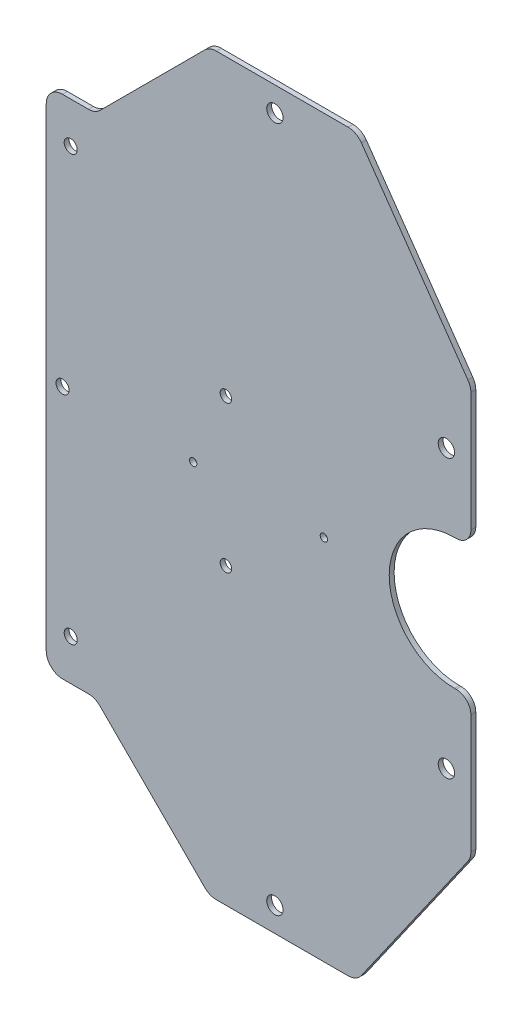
from build123d import *

# Parameters (mm, degrees)
ESQUISSE1_R          = 4
ESQUISSE1_R_2        = 5
ESQUISSE1_R_3        = 3.5
ESQUISSE1_R_4        = 2.25
BASE_EXTRUSION_DEPTH = 3


with BuildPart() as part:
    # Esquisse1 → Base-Extrusion (new body)
    with BuildSketch(Plane.XY):
        with BuildLine():
            Line((-149.928932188, 222.071067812), (-214.071067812, 157.928932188))
            ThreePointArc((-214.071067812, 157.928932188), (-217.3153013, 155.761204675), (-221.142135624, 155))
            Line((-221.142135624, 155), (-237, 155))
            ThreePointArc((-237, 155), (-244.071067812, 152.071067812), (-247, 145))
            Line((-247, 145), (-247, 125))
            Line((-247, 125), (-247, -125))
            Line((-247, -125), (-247, -145))
            ThreePointArc((-247, -145), (-244.071067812, -152.071067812), (-237, -155))
            Line((-237, -155), (-221.142135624, -155))
            ThreePointArc((-221.142135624, -155), (-217.3153013, -155.761204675), (-214.071067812, -157.928932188))
            Line((-214.071067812, -157.928932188), (-149.928932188, -222.071067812))
            ThreePointArc((-149.928932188, -222.071067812), (-146.6846987, -224.238795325), (-142.857864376, -225))
            Line((-142.857864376, -225), (-62.206555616, -225))
            ThreePointArc((-62.206555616, -225), (-57.588451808, -223.869786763), (-54.014236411, -220.734623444))
            Line((-54.014236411, -220.734623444), (11.192319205, -127.582401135))
            ThreePointArc((11.192319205, -127.582401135), (12.537378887, -124.854171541), (13, -121.847777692))
            Line((13, -121.847777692), (13, -49))
            ThreePointArc((13, -49), (10.363961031, -42.636038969), (4, -40))
            Line((4, -40), (3, -40))
            ThreePointArc((3, -40), (-37, 0), (3, 40))
            Line((3, 40), (4, 40))
            ThreePointArc((4, 40), (10.363961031, 42.636038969), (13, 49))
            Line((13, 49), (13, 121.847777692))
            ThreePointArc((13, 121.847777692), (12.537378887, 124.854171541), (11.192319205, 127.582401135))
            Line((11.192319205, 127.582401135), (-54.014236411, 220.734623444))
            ThreePointArc((-54.014236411, 220.734623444), (-57.588451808, 223.869786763), (-62.206555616, 225))
            Line((-62.206555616, 225), (-142.857864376, 225))
            ThreePointArc((-142.857864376, 225), (-146.6846987, 224.238795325), (-149.928932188, 222.071067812))
        make_face()
        with Locations((-232, 130)):
            Circle(ESQUISSE1_R, mode=Mode.SUBTRACT)
        with Locations((-2, -85)):
            Circle(ESQUISSE1_R_2, mode=Mode.SUBTRACT)
        with Locations((-107, 210)):
            Circle(ESQUISSE1_R_2, mode=Mode.SUBTRACT)
        with Locations((-232, -130)):
            Circle(ESQUISSE1_R, mode=Mode.SUBTRACT)
        with Locations((-237, 0)):
            Circle(ESQUISSE1_R, mode=Mode.SUBTRACT)
        with Locations((-2, 85)):
            Circle(ESQUISSE1_R_2, mode=Mode.SUBTRACT)
        with Locations((-107, -210)):
            Circle(ESQUISSE1_R_2, mode=Mode.SUBTRACT)
        with Locations((-137, 45)):
            Circle(ESQUISSE1_R_3, mode=Mode.SUBTRACT)
        with Locations((-137, -45)):
            Circle(ESQUISSE1_R_3, mode=Mode.SUBTRACT)
        with Locations((-157, 0)):
            Circle(ESQUISSE1_R_4, mode=Mode.SUBTRACT)
        with Locations((-77, 0)):
            Circle(ESQUISSE1_R_4, mode=Mode.SUBTRACT)
    extrude(amount=BASE_EXTRUSION_DEPTH)


solid = part.part
